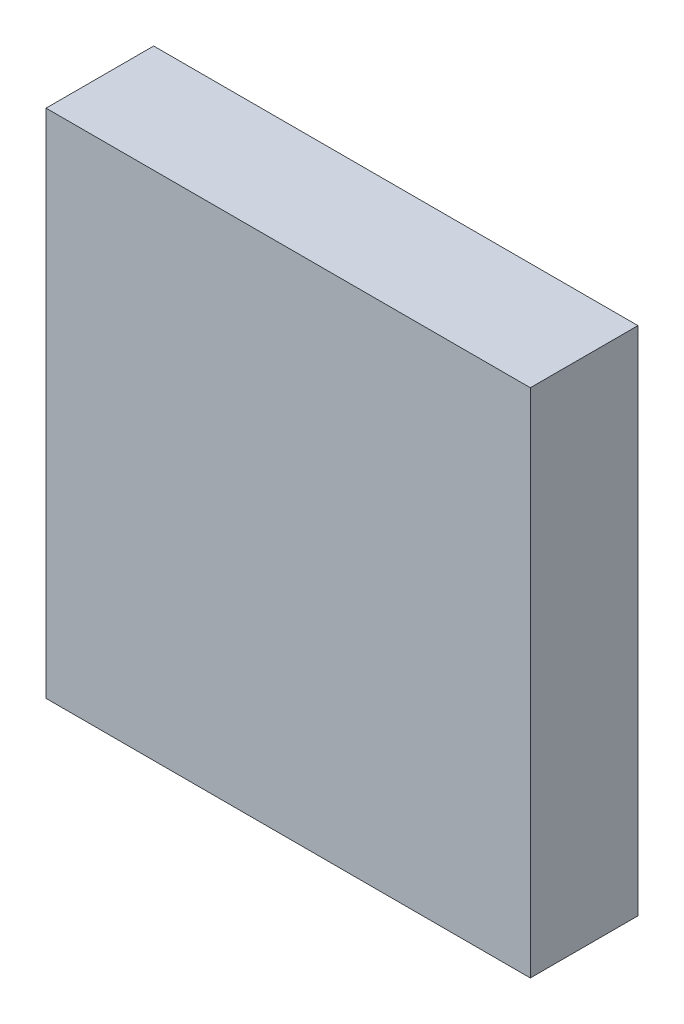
from build123d import *

# Parameters (mm, degrees)
ESQUISSE1_W        = 90
ESQUISSE1_H        = 95
BOSS_EXTRU_1_DEPTH = 20


with BuildPart() as part:
    # Esquisse1 → Boss.-Extru.1 (new body)
    with BuildSketch(Plane.XY):
        with Locations((45, 47.5)):
            Rectangle(ESQUISSE1_W, ESQUISSE1_H)
    extrude(amount=BOSS_EXTRU_1_DEPTH)


solid = part.part
